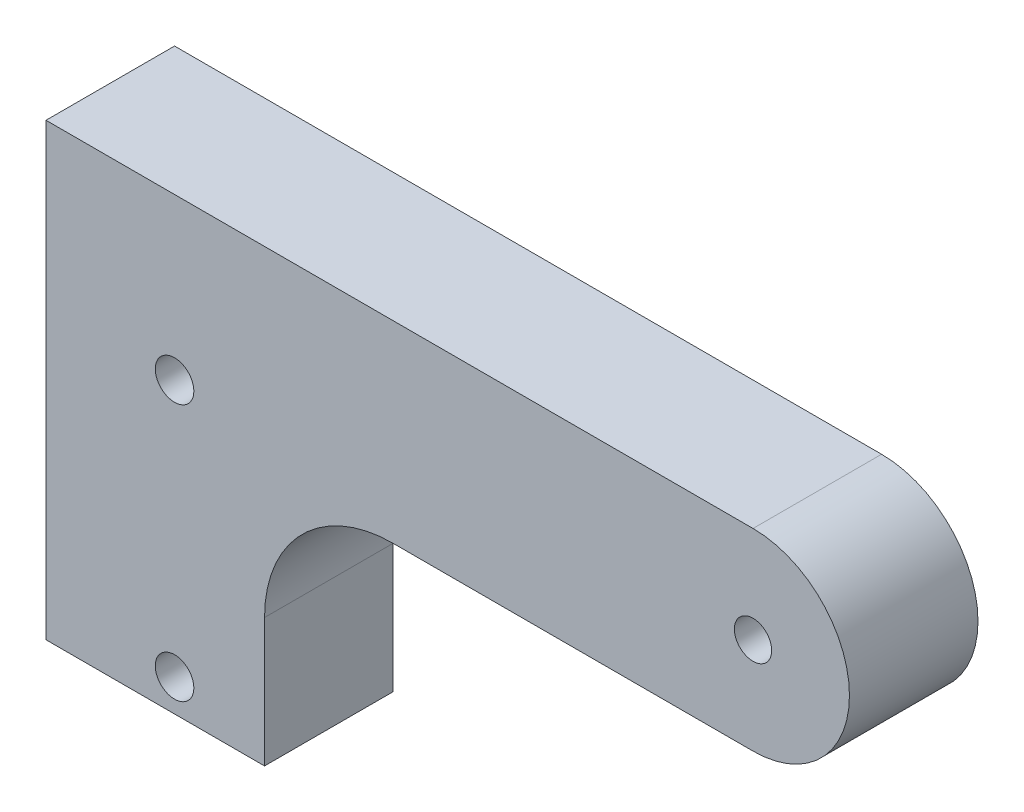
ISO-10303-21;
HEADER;
FILE_DESCRIPTION(('STEP AP214'),'2;1');
FILE_NAME('part.step','',(''),(''),'','','');
FILE_SCHEMA(('AUTOMOTIVE_DESIGN { 1 0 10303 214 1 1 1 1 }'));
ENDSEC;
DATA;
#1=APPLICATION_CONTEXT('core data for automotive mechanical design processes');
#2=APPLICATION_PROTOCOL_DEFINITION('international standard','automotive_design',2000,#1);
#3=PRODUCT_CONTEXT('',#1,'mechanical');
#4=PRODUCT('Part','Part','',(#3));
#5=PRODUCT_RELATED_PRODUCT_CATEGORY('part','',(#4));
#6=PRODUCT_DEFINITION_FORMATION('','',#4);
#7=PRODUCT_DEFINITION_CONTEXT('part definition',#1,'design');
#8=PRODUCT_DEFINITION('design','',#6,#7);
#9=PRODUCT_DEFINITION_SHAPE('','',#8);
#10=(LENGTH_UNIT() NAMED_UNIT(*) SI_UNIT(.MILLI.,.METRE.));
#11=(NAMED_UNIT(*) PLANE_ANGLE_UNIT() SI_UNIT($,.RADIAN.));
#12=(NAMED_UNIT(*) SI_UNIT($,.STERADIAN.) SOLID_ANGLE_UNIT());
#13=UNCERTAINTY_MEASURE_WITH_UNIT(LENGTH_MEASURE(1.E-05),#10,'distance_accuracy_value','');
#14=(GEOMETRIC_REPRESENTATION_CONTEXT(3) GLOBAL_UNCERTAINTY_ASSIGNED_CONTEXT((#13)) GLOBAL_UNIT_ASSIGNED_CONTEXT((#10,
#11,#12)) REPRESENTATION_CONTEXT('',''));
#15=CARTESIAN_POINT('',(0.,0.,0.));
#16=DIRECTION('',(0.,0.,1.));
#17=DIRECTION('',(1.,0.,0.));
#18=AXIS2_PLACEMENT_3D('',#15,#16,#17);
#19=CARTESIAN_POINT('',(12.4747144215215,2.2209049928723,10.));
#20=DIRECTION('',(0.,0.,1.));
#21=DIRECTION('',(1.,0.,0.));
#22=AXIS2_PLACEMENT_3D('',#19,#20,#21);
#23=PLANE('',#22);
#24=CARTESIAN_POINT('',(-32.5252855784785,-22.7790950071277,10.));
#25=DIRECTION('',(0.,0.,1.));
#26=DIRECTION('',(1.,0.,0.));
#27=AXIS2_PLACEMENT_3D('',#24,#25,#26);
#28=CIRCLE('',#27,1.5);
#29=CARTESIAN_POINT('',(-31.0252855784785,-22.7790950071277,10.));
#30=VERTEX_POINT('',#29);
#31=EDGE_CURVE('E176',#30,#30,#28,.T.);
#32=ORIENTED_EDGE('',*,*,#31,.F.);
#33=EDGE_LOOP('',(#32));
#34=FACE_BOUND('',#33,.T.);
#35=CARTESIAN_POINT('',(-32.5252855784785,-2.77909500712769,10.));
#36=DIRECTION('',(0.,0.,1.));
#37=DIRECTION('',(1.,0.,0.));
#38=AXIS2_PLACEMENT_3D('',#35,#36,#37);
#39=CIRCLE('',#38,1.5);
#40=CARTESIAN_POINT('',(-31.0252855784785,-2.77909500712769,10.));
#41=VERTEX_POINT('',#40);
#42=EDGE_CURVE('E170',#41,#41,#39,.T.);
#43=ORIENTED_EDGE('',*,*,#42,.F.);
#44=EDGE_LOOP('',(#43));
#45=FACE_BOUND('',#44,.T.);
#46=DIRECTION('',(1.,0.,0.));
#47=VECTOR('',#46,1.);
#48=CARTESIAN_POINT('',(-25.5252855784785,-25.2790950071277,10.));
#49=LINE('',#48,#47);
#50=CARTESIAN_POINT('',(-42.5252855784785,-25.2790950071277,10.));
#51=VERTEX_POINT('',#50);
#52=CARTESIAN_POINT('',(-25.5252855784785,-25.2790950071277,10.));
#53=VERTEX_POINT('',#52);
#54=EDGE_CURVE('E140',#51,#53,#49,.T.);
#55=ORIENTED_EDGE('',*,*,#54,.T.);
#56=DIRECTION('',(0.,1.,0.));
#57=VECTOR('',#56,1.);
#58=CARTESIAN_POINT('',(-25.5252855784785,-15.2790950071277,10.));
#59=LINE('',#58,#57);
#60=CARTESIAN_POINT('',(-25.5252855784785,-15.2790950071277,10.));
#61=VERTEX_POINT('',#60);
#62=EDGE_CURVE('E93',#53,#61,#59,.T.);
#63=ORIENTED_EDGE('',*,*,#62,.T.);
#64=CARTESIAN_POINT('',(-15.5252855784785,-15.2790950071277,10.));
#65=DIRECTION('',(0.,0.,-1.));
#66=DIRECTION('',(1.,0.,0.));
#67=AXIS2_PLACEMENT_3D('',#64,#65,#66);
#68=CIRCLE('',#67,10.);
#69=CARTESIAN_POINT('',(-15.5252855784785,-5.2790950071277,10.));
#70=VERTEX_POINT('',#69);
#71=EDGE_CURVE('E152',#61,#70,#68,.T.);
#72=ORIENTED_EDGE('',*,*,#71,.T.);
#73=DIRECTION('',(1.,0.,0.));
#74=VECTOR('',#73,1.);
#75=CARTESIAN_POINT('',(-15.5252855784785,-5.2790950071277,10.));
#76=LINE('',#75,#74);
#77=CARTESIAN_POINT('',(12.4747144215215,-5.2790950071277,10.));
#78=VERTEX_POINT('',#77);
#79=EDGE_CURVE('E109',#70,#78,#76,.T.);
#80=ORIENTED_EDGE('',*,*,#79,.T.);
#81=CARTESIAN_POINT('',(12.4747144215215,2.2209049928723,10.));
#82=DIRECTION('',(0.,0.,1.));
#83=DIRECTION('',(1.,0.,0.));
#84=AXIS2_PLACEMENT_3D('',#81,#82,#83);
#85=CIRCLE('',#84,7.5);
#86=CARTESIAN_POINT('',(12.4747144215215,9.72090499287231,10.));
#87=VERTEX_POINT('',#86);
#88=EDGE_CURVE('E103',#78,#87,#85,.T.);
#89=ORIENTED_EDGE('',*,*,#88,.T.);
#90=DIRECTION('',(-1.,0.,0.));
#91=VECTOR('',#90,1.);
#92=CARTESIAN_POINT('',(12.4747144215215,9.72090499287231,10.));
#93=LINE('',#92,#91);
#94=CARTESIAN_POINT('',(-42.5252855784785,9.7209049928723,10.));
#95=VERTEX_POINT('',#94);
#96=EDGE_CURVE('E107',#87,#95,#93,.T.);
#97=ORIENTED_EDGE('',*,*,#96,.T.);
#98=DIRECTION('',(0.,-1.,0.));
#99=VECTOR('',#98,1.);
#100=CARTESIAN_POINT('',(-42.5252855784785,-25.2790950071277,10.));
#101=LINE('',#100,#99);
#102=EDGE_CURVE('E53',#95,#51,#101,.T.);
#103=ORIENTED_EDGE('',*,*,#102,.T.);
#104=EDGE_LOOP('',(#55,#63,#72,#80,#89,#97,#103));
#105=FACE_BOUND('',#104,.T.);
#106=CARTESIAN_POINT('',(12.4747144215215,2.2209049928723,10.));
#107=DIRECTION('',(0.,0.,1.));
#108=DIRECTION('',(1.,0.,0.));
#109=AXIS2_PLACEMENT_3D('',#106,#107,#108);
#110=CIRCLE('',#109,1.45);
#111=CARTESIAN_POINT('',(13.9247144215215,2.2209049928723,10.));
#112=VERTEX_POINT('',#111);
#113=EDGE_CURVE('E131',#112,#112,#110,.T.);
#114=ORIENTED_EDGE('',*,*,#113,.F.);
#115=EDGE_LOOP('',(#114));
#116=FACE_BOUND('',#115,.T.);
#117=ADVANCED_FACE('F36',(#34,#45,#105,#116),#23,.T.);
#118=CARTESIAN_POINT('',(12.4747144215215,2.2209049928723,0.));
#119=DIRECTION('',(0.,0.,1.));
#120=DIRECTION('',(1.,0.,0.));
#121=AXIS2_PLACEMENT_3D('',#118,#119,#120);
#122=PLANE('',#121);
#123=CARTESIAN_POINT('',(-32.5252855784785,-22.7790950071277,0.));
#124=DIRECTION('',(0.,0.,1.));
#125=DIRECTION('',(1.,0.,0.));
#126=AXIS2_PLACEMENT_3D('',#123,#124,#125);
#127=CIRCLE('',#126,1.5);
#128=CARTESIAN_POINT('',(-31.0252855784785,-22.7790950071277,0.));
#129=VERTEX_POINT('',#128);
#130=EDGE_CURVE('E173',#129,#129,#127,.T.);
#131=ORIENTED_EDGE('',*,*,#130,.T.);
#132=EDGE_LOOP('',(#131));
#133=FACE_BOUND('',#132,.T.);
#134=CARTESIAN_POINT('',(-32.5252855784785,-2.77909500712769,0.));
#135=DIRECTION('',(0.,0.,1.));
#136=DIRECTION('',(1.,0.,0.));
#137=AXIS2_PLACEMENT_3D('',#134,#135,#136);
#138=CIRCLE('',#137,1.5);
#139=CARTESIAN_POINT('',(-31.0252855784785,-2.77909500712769,0.));
#140=VERTEX_POINT('',#139);
#141=EDGE_CURVE('E167',#140,#140,#138,.T.);
#142=ORIENTED_EDGE('',*,*,#141,.T.);
#143=EDGE_LOOP('',(#142));
#144=FACE_BOUND('',#143,.T.);
#145=DIRECTION('',(1.,0.,0.));
#146=VECTOR('',#145,1.);
#147=CARTESIAN_POINT('',(-25.5252855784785,-25.2790950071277,0.));
#148=LINE('',#147,#146);
#149=CARTESIAN_POINT('',(-42.5252855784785,-25.2790950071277,0.));
#150=VERTEX_POINT('',#149);
#151=CARTESIAN_POINT('',(-25.5252855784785,-25.2790950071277,0.));
#152=VERTEX_POINT('',#151);
#153=EDGE_CURVE('E127',#150,#152,#148,.T.);
#154=ORIENTED_EDGE('',*,*,#153,.F.);
#155=DIRECTION('',(0.,-1.,0.));
#156=VECTOR('',#155,1.);
#157=CARTESIAN_POINT('',(-42.5252855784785,-25.2790950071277,0.));
#158=LINE('',#157,#156);
#159=CARTESIAN_POINT('',(-42.5252855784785,9.7209049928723,0.));
#160=VERTEX_POINT('',#159);
#161=EDGE_CURVE('E85',#160,#150,#158,.T.);
#162=ORIENTED_EDGE('',*,*,#161,.F.);
#163=DIRECTION('',(-1.,0.,0.));
#164=VECTOR('',#163,1.);
#165=CARTESIAN_POINT('',(12.4747144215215,9.72090499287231,0.));
#166=LINE('',#165,#164);
#167=CARTESIAN_POINT('',(12.4747144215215,9.72090499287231,0.));
#168=VERTEX_POINT('',#167);
#169=EDGE_CURVE('E79',#168,#160,#166,.T.);
#170=ORIENTED_EDGE('',*,*,#169,.F.);
#171=CARTESIAN_POINT('',(12.4747144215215,2.2209049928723,0.));
#172=DIRECTION('',(0.,0.,1.));
#173=DIRECTION('',(1.,0.,0.));
#174=AXIS2_PLACEMENT_3D('',#171,#172,#173);
#175=CIRCLE('',#174,7.5);
#176=CARTESIAN_POINT('',(12.4747144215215,-5.2790950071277,0.));
#177=VERTEX_POINT('',#176);
#178=EDGE_CURVE('E117',#177,#168,#175,.T.);
#179=ORIENTED_EDGE('',*,*,#178,.F.);
#180=DIRECTION('',(1.,0.,0.));
#181=VECTOR('',#180,1.);
#182=CARTESIAN_POINT('',(-15.5252855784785,-5.2790950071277,0.));
#183=LINE('',#182,#181);
#184=CARTESIAN_POINT('',(-15.5252855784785,-5.2790950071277,0.));
#185=VERTEX_POINT('',#184);
#186=EDGE_CURVE('E135',#185,#177,#183,.T.);
#187=ORIENTED_EDGE('',*,*,#186,.F.);
#188=CARTESIAN_POINT('',(-15.5252855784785,-15.2790950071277,0.));
#189=DIRECTION('',(0.,0.,-1.));
#190=DIRECTION('',(1.,0.,0.));
#191=AXIS2_PLACEMENT_3D('',#188,#189,#190);
#192=CIRCLE('',#191,10.);
#193=CARTESIAN_POINT('',(-25.5252855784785,-15.2790950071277,0.));
#194=VERTEX_POINT('',#193);
#195=EDGE_CURVE('E133',#194,#185,#192,.T.);
#196=ORIENTED_EDGE('',*,*,#195,.F.);
#197=DIRECTION('',(0.,1.,0.));
#198=VECTOR('',#197,1.);
#199=CARTESIAN_POINT('',(-25.5252855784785,-15.2790950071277,0.));
#200=LINE('',#199,#198);
#201=EDGE_CURVE('E130',#152,#194,#200,.T.);
#202=ORIENTED_EDGE('',*,*,#201,.F.);
#203=EDGE_LOOP('',(#154,#162,#170,#179,#187,#196,#202));
#204=FACE_BOUND('',#203,.T.);
#205=CARTESIAN_POINT('',(12.4747144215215,2.2209049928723,0.));
#206=DIRECTION('',(0.,0.,1.));
#207=DIRECTION('',(1.,0.,0.));
#208=AXIS2_PLACEMENT_3D('',#205,#206,#207);
#209=CIRCLE('',#208,1.45);
#210=CARTESIAN_POINT('',(13.9247144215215,2.2209049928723,0.));
#211=VERTEX_POINT('',#210);
#212=EDGE_CURVE('E164',#211,#211,#209,.T.);
#213=ORIENTED_EDGE('',*,*,#212,.T.);
#214=EDGE_LOOP('',(#213));
#215=FACE_BOUND('',#214,.T.);
#216=ADVANCED_FACE('F156',(#133,#144,#204,#215),#122,.F.);
#217=CARTESIAN_POINT('',(-25.5252855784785,-25.2790950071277,10.));
#218=DIRECTION('',(0.,1.,0.));
#219=DIRECTION('',(0.,0.,1.));
#220=AXIS2_PLACEMENT_3D('',#217,#218,#219);
#221=PLANE('',#220);
#222=ORIENTED_EDGE('',*,*,#153,.T.);
#223=DIRECTION('',(0.,0.,-1.));
#224=VECTOR('',#223,1.);
#225=CARTESIAN_POINT('',(-25.5252855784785,-25.2790950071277,10.));
#226=LINE('',#225,#224);
#227=EDGE_CURVE('E11',#53,#152,#226,.T.);
#228=ORIENTED_EDGE('',*,*,#227,.F.);
#229=ORIENTED_EDGE('',*,*,#54,.F.);
#230=DIRECTION('',(0.,0.,-1.));
#231=VECTOR('',#230,1.);
#232=CARTESIAN_POINT('',(-42.5252855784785,-25.2790950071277,10.));
#233=LINE('',#232,#231);
#234=EDGE_CURVE('E123',#51,#150,#233,.T.);
#235=ORIENTED_EDGE('',*,*,#234,.T.);
#236=EDGE_LOOP('',(#222,#228,#229,#235));
#237=FACE_BOUND('',#236,.T.);
#238=ADVANCED_FACE('F38',(#237),#221,.F.);
#239=CARTESIAN_POINT('',(-25.5252855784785,-15.2790950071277,10.));
#240=DIRECTION('',(-1.,0.,0.));
#241=DIRECTION('',(0.,-1.,0.));
#242=AXIS2_PLACEMENT_3D('',#239,#240,#241);
#243=PLANE('',#242);
#244=ORIENTED_EDGE('',*,*,#201,.T.);
#245=DIRECTION('',(0.,0.,-1.));
#246=VECTOR('',#245,1.);
#247=CARTESIAN_POINT('',(-25.5252855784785,-15.2790950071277,10.));
#248=LINE('',#247,#246);
#249=EDGE_CURVE('E45',#61,#194,#248,.T.);
#250=ORIENTED_EDGE('',*,*,#249,.F.);
#251=ORIENTED_EDGE('',*,*,#62,.F.);
#252=ORIENTED_EDGE('',*,*,#227,.T.);
#253=EDGE_LOOP('',(#244,#250,#251,#252));
#254=FACE_BOUND('',#253,.T.);
#255=ADVANCED_FACE('F219',(#254),#243,.F.);
#256=CARTESIAN_POINT('',(-15.5252855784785,-15.2790950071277,10.));
#257=DIRECTION('',(0.,0.,-1.));
#258=DIRECTION('',(-1.,0.,0.));
#259=AXIS2_PLACEMENT_3D('',#256,#257,#258);
#260=CYLINDRICAL_SURFACE('',#259,10.);
#261=ORIENTED_EDGE('',*,*,#195,.T.);
#262=DIRECTION('',(0.,0.,-1.));
#263=VECTOR('',#262,1.);
#264=CARTESIAN_POINT('',(-15.5252855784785,-5.2790950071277,10.));
#265=LINE('',#264,#263);
#266=EDGE_CURVE('E144',#70,#185,#265,.T.);
#267=ORIENTED_EDGE('',*,*,#266,.F.);
#268=ORIENTED_EDGE('',*,*,#71,.F.);
#269=ORIENTED_EDGE('',*,*,#249,.T.);
#270=EDGE_LOOP('',(#261,#267,#268,#269));
#271=FACE_BOUND('',#270,.T.);
#272=ADVANCED_FACE('F150',(#271),#260,.F.);
#273=CARTESIAN_POINT('',(-15.5252855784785,-5.2790950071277,10.));
#274=DIRECTION('',(0.,1.,0.));
#275=DIRECTION('',(0.,0.,1.));
#276=AXIS2_PLACEMENT_3D('',#273,#274,#275);
#277=PLANE('',#276);
#278=ORIENTED_EDGE('',*,*,#186,.T.);
#279=DIRECTION('',(0.,0.,-1.));
#280=VECTOR('',#279,1.);
#281=CARTESIAN_POINT('',(12.4747144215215,-5.2790950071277,10.));
#282=LINE('',#281,#280);
#283=EDGE_CURVE('E118',#78,#177,#282,.T.);
#284=ORIENTED_EDGE('',*,*,#283,.F.);
#285=ORIENTED_EDGE('',*,*,#79,.F.);
#286=ORIENTED_EDGE('',*,*,#266,.T.);
#287=EDGE_LOOP('',(#278,#284,#285,#286));
#288=FACE_BOUND('',#287,.T.);
#289=ADVANCED_FACE('F159',(#288),#277,.F.);
#290=CARTESIAN_POINT('',(12.4747144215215,2.2209049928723,10.));
#291=DIRECTION('',(0.,0.,-1.));
#292=DIRECTION('',(-1.,0.,0.));
#293=AXIS2_PLACEMENT_3D('',#290,#291,#292);
#294=CYLINDRICAL_SURFACE('',#293,7.5);
#295=ORIENTED_EDGE('',*,*,#178,.T.);
#296=DIRECTION('',(0.,0.,-1.));
#297=VECTOR('',#296,1.);
#298=CARTESIAN_POINT('',(12.4747144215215,9.72090499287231,10.));
#299=LINE('',#298,#297);
#300=EDGE_CURVE('E114',#87,#168,#299,.T.);
#301=ORIENTED_EDGE('',*,*,#300,.F.);
#302=ORIENTED_EDGE('',*,*,#88,.F.);
#303=ORIENTED_EDGE('',*,*,#283,.T.);
#304=EDGE_LOOP('',(#295,#301,#302,#303));
#305=FACE_BOUND('',#304,.T.);
#306=ADVANCED_FACE('F115',(#305),#294,.T.);
#307=CARTESIAN_POINT('',(12.4747144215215,9.72090499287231,10.));
#308=DIRECTION('',(0.,-1.,0.));
#309=DIRECTION('',(1.,0.,0.));
#310=AXIS2_PLACEMENT_3D('',#307,#308,#309);
#311=PLANE('',#310);
#312=ORIENTED_EDGE('',*,*,#169,.T.);
#313=DIRECTION('',(0.,0.,-1.));
#314=VECTOR('',#313,1.);
#315=CARTESIAN_POINT('',(-42.5252855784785,9.7209049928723,10.));
#316=LINE('',#315,#314);
#317=EDGE_CURVE('E119',#95,#160,#316,.T.);
#318=ORIENTED_EDGE('',*,*,#317,.F.);
#319=ORIENTED_EDGE('',*,*,#96,.F.);
#320=ORIENTED_EDGE('',*,*,#300,.T.);
#321=EDGE_LOOP('',(#312,#318,#319,#320));
#322=FACE_BOUND('',#321,.T.);
#323=ADVANCED_FACE('F121',(#322),#311,.F.);
#324=CARTESIAN_POINT('',(-42.5252855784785,-25.2790950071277,10.));
#325=DIRECTION('',(1.,0.,0.));
#326=DIRECTION('',(0.,0.,-1.));
#327=AXIS2_PLACEMENT_3D('',#324,#325,#326);
#328=PLANE('',#327);
#329=ORIENTED_EDGE('',*,*,#161,.T.);
#330=ORIENTED_EDGE('',*,*,#234,.F.);
#331=ORIENTED_EDGE('',*,*,#102,.F.);
#332=ORIENTED_EDGE('',*,*,#317,.T.);
#333=EDGE_LOOP('',(#329,#330,#331,#332));
#334=FACE_BOUND('',#333,.T.);
#335=ADVANCED_FACE('F203',(#334),#328,.F.);
#336=CARTESIAN_POINT('',(12.4747144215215,2.2209049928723,10.));
#337=DIRECTION('',(0.,0.,-1.));
#338=DIRECTION('',(-1.,0.,0.));
#339=AXIS2_PLACEMENT_3D('',#336,#337,#338);
#340=CYLINDRICAL_SURFACE('',#339,1.45);
#341=ORIENTED_EDGE('',*,*,#113,.T.);
#342=EDGE_LOOP('',(#341));
#343=FACE_BOUND('',#342,.T.);
#344=ORIENTED_EDGE('',*,*,#212,.F.);
#345=EDGE_LOOP('',(#344));
#346=FACE_BOUND('',#345,.T.);
#347=ADVANCED_FACE('F197',(#343,#346),#340,.F.);
#348=CARTESIAN_POINT('',(-32.5252855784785,-2.77909500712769,0.));
#349=DIRECTION('',(0.,0.,1.));
#350=DIRECTION('',(1.,0.,0.));
#351=AXIS2_PLACEMENT_3D('',#348,#349,#350);
#352=CYLINDRICAL_SURFACE('',#351,1.5);
#353=ORIENTED_EDGE('',*,*,#141,.F.);
#354=EDGE_LOOP('',(#353));
#355=FACE_BOUND('',#354,.T.);
#356=ORIENTED_EDGE('',*,*,#42,.T.);
#357=EDGE_LOOP('',(#356));
#358=FACE_BOUND('',#357,.T.);
#359=ADVANCED_FACE('F187',(#355,#358),#352,.F.);
#360=CARTESIAN_POINT('',(-32.5252855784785,-22.7790950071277,0.));
#361=DIRECTION('',(0.,0.,1.));
#362=DIRECTION('',(1.,0.,0.));
#363=AXIS2_PLACEMENT_3D('',#360,#361,#362);
#364=CYLINDRICAL_SURFACE('',#363,1.5);
#365=ORIENTED_EDGE('',*,*,#130,.F.);
#366=EDGE_LOOP('',(#365));
#367=FACE_BOUND('',#366,.T.);
#368=ORIENTED_EDGE('',*,*,#31,.T.);
#369=EDGE_LOOP('',(#368));
#370=FACE_BOUND('',#369,.T.);
#371=ADVANCED_FACE('F184',(#367,#370),#364,.F.);
#372=CLOSED_SHELL('',(#117,#216,#238,#255,#272,#289,#306,#323,#335,#347,#359,#371));
#373=MANIFOLD_SOLID_BREP('B2',#372);
#374=ADVANCED_BREP_SHAPE_REPRESENTATION('',(#18,#373),#14);
#375=SHAPE_DEFINITION_REPRESENTATION(#9,#374);
ENDSEC;
END-ISO-10303-21;
